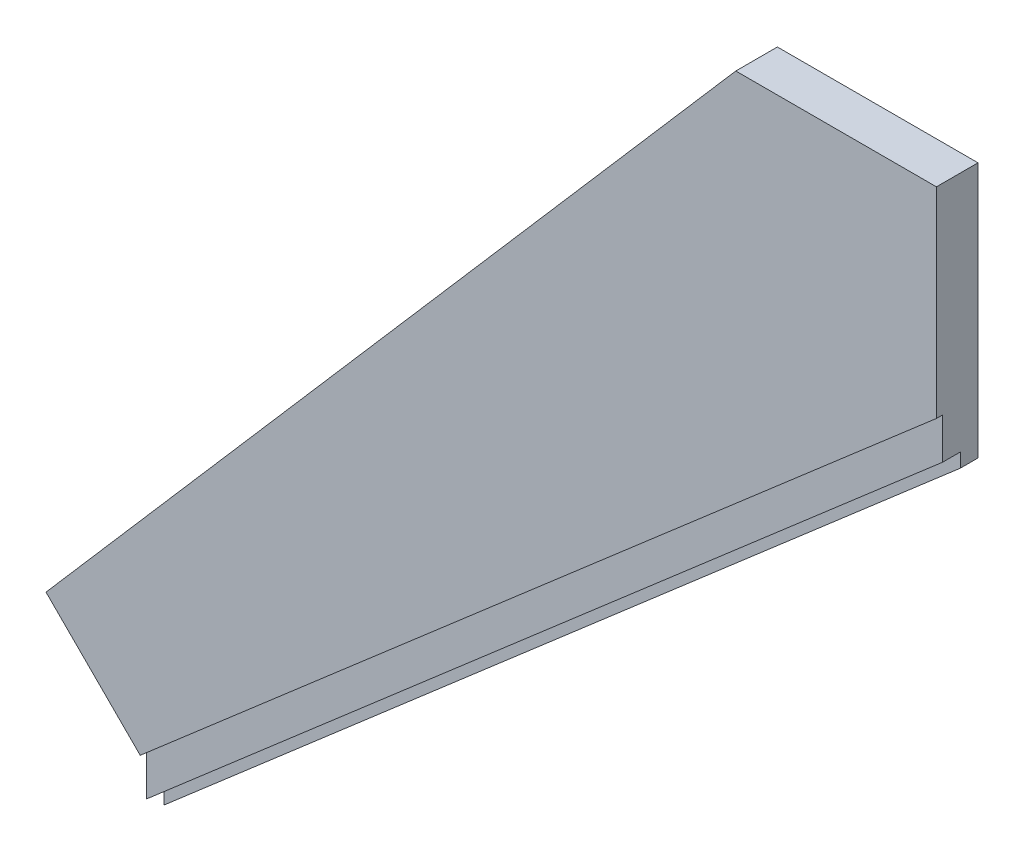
from build123d import *

# Parameters (mm, degrees)
EXTRUDE_1_DEPTH = 47
EXTRUDE_2_DEPTH = 40
EXTRUDE_3_DEPTH = 20


with BuildPart() as part:
    # Sketch 1 → Extrude 1 (new body)
    with BuildSketch(Plane.XY):
        Polygon((0, 0), (-226.783248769, 0), (-1006.487052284, -900), (-900, -1006.487052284), (0, -226.783248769), align=None)
    extrude(amount=EXTRUDE_1_DEPTH)

    # Sketch 2 → Extrude 2 (add)
    with BuildSketch(Plane(origin=(0, 0, 0), x_dir=(-1, 0, 0), z_dir=(0, 0, -1))):
        Polygon((0, -226.783248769), (0, -273.091049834), (900, -1052.79485335), (900, -1006.487052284), align=None)
    extrude(amount=-EXTRUDE_2_DEPTH)

    # Sketch 3 → Extrude 3 (add)
    with BuildSketch(Plane(origin=(0, 0, 0), x_dir=(-1, 0, 0), z_dir=(0, 0, -1))):
        Polygon((0, -273.091049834), (0, -288.968010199), (900, -1068.671813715), (900, -1052.79485335), align=None)
    extrude(amount=-EXTRUDE_3_DEPTH)


solid = part.part
